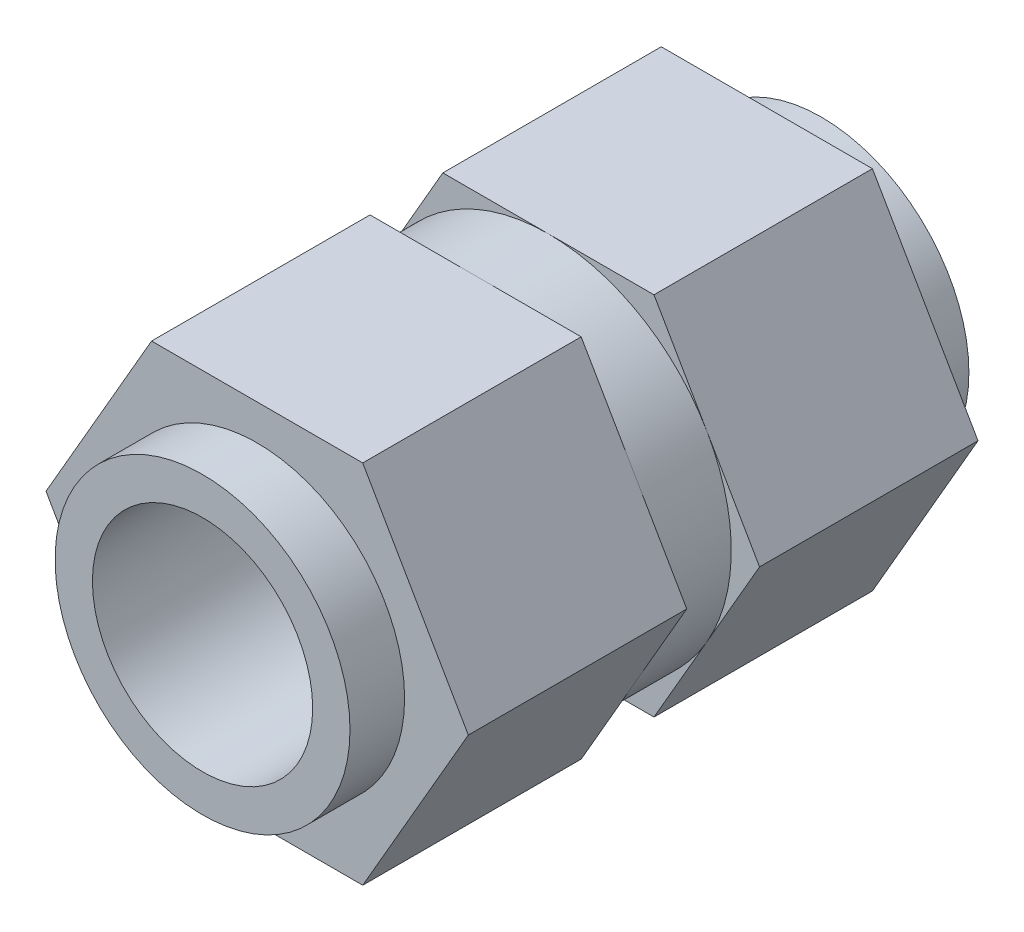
ISO-10303-21;
HEADER;
FILE_DESCRIPTION(('STEP AP214'),'2;1');
FILE_NAME('part.step','',(''),(''),'','','');
FILE_SCHEMA(('AUTOMOTIVE_DESIGN { 1 0 10303 214 1 1 1 1 }'));
ENDSEC;
DATA;
#1=APPLICATION_CONTEXT('core data for automotive mechanical design processes');
#2=APPLICATION_PROTOCOL_DEFINITION('international standard','automotive_design',2000,#1);
#3=PRODUCT_CONTEXT('',#1,'mechanical');
#4=PRODUCT('Part','Part','',(#3));
#5=PRODUCT_RELATED_PRODUCT_CATEGORY('part','',(#4));
#6=PRODUCT_DEFINITION_FORMATION('','',#4);
#7=PRODUCT_DEFINITION_CONTEXT('part definition',#1,'design');
#8=PRODUCT_DEFINITION('design','',#6,#7);
#9=PRODUCT_DEFINITION_SHAPE('','',#8);
#10=(LENGTH_UNIT() NAMED_UNIT(*) SI_UNIT(.MILLI.,.METRE.));
#11=(NAMED_UNIT(*) PLANE_ANGLE_UNIT() SI_UNIT($,.RADIAN.));
#12=(NAMED_UNIT(*) SI_UNIT($,.STERADIAN.) SOLID_ANGLE_UNIT());
#13=UNCERTAINTY_MEASURE_WITH_UNIT(LENGTH_MEASURE(1.E-05),#10,'distance_accuracy_value','');
#14=(GEOMETRIC_REPRESENTATION_CONTEXT(3) GLOBAL_UNCERTAINTY_ASSIGNED_CONTEXT((#13)) GLOBAL_UNIT_ASSIGNED_CONTEXT((#10,
#11,#12)) REPRESENTATION_CONTEXT('',''));
#15=CARTESIAN_POINT('',(0.,0.,0.));
#16=DIRECTION('',(0.,0.,1.));
#17=DIRECTION('',(1.,0.,0.));
#18=AXIS2_PLACEMENT_3D('',#15,#16,#17);
#19=CARTESIAN_POINT('',(0.,0.,14.));
#20=DIRECTION('',(0.,0.,1.));
#21=DIRECTION('',(1.,0.,0.));
#22=AXIS2_PLACEMENT_3D('',#19,#20,#21);
#23=PLANE('',#22);
#24=DIRECTION('',(-0.499999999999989,-0.866025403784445,0.));
#25=VECTOR('',#24,1.);
#26=CARTESIAN_POINT('',(-2.90000000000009,5.02294734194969,14.));
#27=LINE('',#26,#25);
#28=CARTESIAN_POINT('',(-2.90000000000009,5.02294734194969,14.));
#29=VERTEX_POINT('',#28);
#30=CARTESIAN_POINT('',(-5.8,0.,14.));
#31=VERTEX_POINT('',#30);
#32=EDGE_CURVE('E166',#29,#31,#27,.T.);
#33=ORIENTED_EDGE('',*,*,#32,.T.);
#34=DIRECTION('',(0.500000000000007,-0.866025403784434,0.));
#35=VECTOR('',#34,1.);
#36=CARTESIAN_POINT('',(-5.8,0.,14.));
#37=LINE('',#36,#35);
#38=CARTESIAN_POINT('',(-2.89999999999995,-5.02294734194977,14.));
#39=VERTEX_POINT('',#38);
#40=EDGE_CURVE('E155',#31,#39,#37,.T.);
#41=ORIENTED_EDGE('',*,*,#40,.T.);
#42=DIRECTION('',(1.,0.,0.));
#43=VECTOR('',#42,1.);
#44=CARTESIAN_POINT('',(-2.89999999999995,-5.02294734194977,14.));
#45=LINE('',#44,#43);
#46=CARTESIAN_POINT('',(2.90000000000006,-5.02294734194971,14.));
#47=VERTEX_POINT('',#46);
#48=EDGE_CURVE('E165',#39,#47,#45,.T.);
#49=ORIENTED_EDGE('',*,*,#48,.T.);
#50=DIRECTION('',(0.499999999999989,0.866025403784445,0.));
#51=VECTOR('',#50,1.);
#52=CARTESIAN_POINT('',(2.90000000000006,-5.02294734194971,14.));
#53=LINE('',#52,#51);
#54=CARTESIAN_POINT('',(5.8,0.,14.));
#55=VERTEX_POINT('',#54);
#56=EDGE_CURVE('E379',#47,#55,#53,.T.);
#57=ORIENTED_EDGE('',*,*,#56,.T.);
#58=DIRECTION('',(-0.500000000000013,0.866025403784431,0.));
#59=VECTOR('',#58,1.);
#60=CARTESIAN_POINT('',(5.8,0.,14.));
#61=LINE('',#60,#59);
#62=CARTESIAN_POINT('',(2.89999999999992,5.02294734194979,14.));
#63=VERTEX_POINT('',#62);
#64=EDGE_CURVE('E394',#55,#63,#61,.T.);
#65=ORIENTED_EDGE('',*,*,#64,.T.);
#66=DIRECTION('',(-1.,0.,0.));
#67=VECTOR('',#66,1.);
#68=CARTESIAN_POINT('',(2.89999999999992,5.02294734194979,14.));
#69=LINE('',#68,#67);
#70=EDGE_CURVE('E171',#63,#29,#69,.T.);
#71=ORIENTED_EDGE('',*,*,#70,.T.);
#72=EDGE_LOOP('',(#33,#41,#49,#57,#65,#71));
#73=FACE_BOUND('',#72,.T.);
#74=CARTESIAN_POINT('',(0.,0.,14.));
#75=DIRECTION('',(0.,0.,1.));
#76=DIRECTION('',(1.,0.,0.));
#77=AXIS2_PLACEMENT_3D('',#74,#75,#76);
#78=CIRCLE('',#77,4.05);
#79=CARTESIAN_POINT('',(4.05,0.,14.));
#80=VERTEX_POINT('',#79);
#81=EDGE_CURVE('E417',#80,#80,#78,.T.);
#82=ORIENTED_EDGE('',*,*,#81,.F.);
#83=EDGE_LOOP('',(#82));
#84=FACE_BOUND('',#83,.T.);
#85=ADVANCED_FACE('F32',(#73,#84),#23,.T.);
#86=CARTESIAN_POINT('',(0.,0.,0.));
#87=DIRECTION('',(0.,0.,1.));
#88=DIRECTION('',(1.,0.,0.));
#89=AXIS2_PLACEMENT_3D('',#86,#87,#88);
#90=PLANE('',#89);
#91=DIRECTION('',(0.499999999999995,0.866025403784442,0.));
#92=VECTOR('',#91,1.);
#93=CARTESIAN_POINT('',(2.90000000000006,-5.02294734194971,0.));
#94=LINE('',#93,#92);
#95=CARTESIAN_POINT('',(2.90000000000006,-5.02294734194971,0.));
#96=VERTEX_POINT('',#95);
#97=CARTESIAN_POINT('',(5.8,0.,0.));
#98=VERTEX_POINT('',#97);
#99=EDGE_CURVE('E193',#96,#98,#94,.T.);
#100=ORIENTED_EDGE('',*,*,#99,.F.);
#101=DIRECTION('',(1.,0.,0.));
#102=VECTOR('',#101,1.);
#103=CARTESIAN_POINT('',(-2.89999999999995,-5.02294734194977,0.));
#104=LINE('',#103,#102);
#105=CARTESIAN_POINT('',(-2.89999999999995,-5.02294734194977,0.));
#106=VERTEX_POINT('',#105);
#107=EDGE_CURVE('E230',#106,#96,#104,.T.);
#108=ORIENTED_EDGE('',*,*,#107,.F.);
#109=DIRECTION('',(0.500000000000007,-0.866025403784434,0.));
#110=VECTOR('',#109,1.);
#111=CARTESIAN_POINT('',(-5.8,0.,0.));
#112=LINE('',#111,#110);
#113=CARTESIAN_POINT('',(-5.8,0.,0.));
#114=VERTEX_POINT('',#113);
#115=EDGE_CURVE('E228',#114,#106,#112,.T.);
#116=ORIENTED_EDGE('',*,*,#115,.F.);
#117=DIRECTION('',(-0.499999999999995,-0.866025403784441,0.));
#118=VECTOR('',#117,1.);
#119=CARTESIAN_POINT('',(-2.90000000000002,5.02294734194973,0.));
#120=LINE('',#119,#118);
#121=CARTESIAN_POINT('',(-2.90000000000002,5.02294734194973,0.));
#122=VERTEX_POINT('',#121);
#123=EDGE_CURVE('E226',#122,#114,#120,.T.);
#124=ORIENTED_EDGE('',*,*,#123,.F.);
#125=DIRECTION('',(-1.,0.,0.));
#126=VECTOR('',#125,1.);
#127=CARTESIAN_POINT('',(2.89999999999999,5.02294734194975,0.));
#128=LINE('',#127,#126);
#129=CARTESIAN_POINT('',(2.89999999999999,5.02294734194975,0.));
#130=VERTEX_POINT('',#129);
#131=EDGE_CURVE('E224',#130,#122,#128,.T.);
#132=ORIENTED_EDGE('',*,*,#131,.F.);
#133=DIRECTION('',(-0.500000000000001,0.866025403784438,0.));
#134=VECTOR('',#133,1.);
#135=CARTESIAN_POINT('',(5.8,0.,0.));
#136=LINE('',#135,#134);
#137=EDGE_CURVE('E222',#98,#130,#136,.T.);
#138=ORIENTED_EDGE('',*,*,#137,.F.);
#139=EDGE_LOOP('',(#100,#108,#116,#124,#132,#138));
#140=FACE_BOUND('',#139,.T.);
#141=CARTESIAN_POINT('',(0.,0.,0.));
#142=DIRECTION('',(0.,0.,1.));
#143=DIRECTION('',(1.,0.,0.));
#144=AXIS2_PLACEMENT_3D('',#141,#142,#143);
#145=CIRCLE('',#144,4.05);
#146=CARTESIAN_POINT('',(4.05,0.,0.));
#147=VERTEX_POINT('',#146);
#148=EDGE_CURVE('E11',#147,#147,#145,.F.);
#149=ORIENTED_EDGE('',*,*,#148,.F.);
#150=EDGE_LOOP('',(#149));
#151=FACE_BOUND('',#150,.T.);
#152=ADVANCED_FACE('F278',(#140,#151),#90,.F.);
#153=CARTESIAN_POINT('',(0.,0.,6.));
#154=DIRECTION('',(0.,0.,1.));
#155=DIRECTION('',(1.,0.,0.));
#156=AXIS2_PLACEMENT_3D('',#153,#154,#155);
#157=PLANE('',#156);
#158=CARTESIAN_POINT('',(0.,0.,6.));
#159=DIRECTION('',(0.,0.,1.));
#160=DIRECTION('',(1.,0.,0.));
#161=AXIS2_PLACEMENT_3D('',#158,#159,#160);
#162=CIRCLE('',#161,5.02294734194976);
#163=CARTESIAN_POINT('',(4.35000000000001,2.51147367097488,6.));
#164=VERTEX_POINT('',#163);
#165=CARTESIAN_POINT('',(0.,5.02294734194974,6.));
#166=VERTEX_POINT('',#165);
#167=EDGE_CURVE('E182',#164,#166,#162,.T.);
#168=ORIENTED_EDGE('',*,*,#167,.F.);
#169=DIRECTION('',(-0.500000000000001,0.866025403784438,0.));
#170=VECTOR('',#169,1.);
#171=CARTESIAN_POINT('',(5.8,0.,6.));
#172=LINE('',#171,#170);
#173=CARTESIAN_POINT('',(2.89999999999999,5.02294734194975,6.));
#174=VERTEX_POINT('',#173);
#175=EDGE_CURVE('E199',#164,#174,#172,.T.);
#176=ORIENTED_EDGE('',*,*,#175,.T.);
#177=DIRECTION('',(-1.,0.,0.));
#178=VECTOR('',#177,1.);
#179=CARTESIAN_POINT('',(2.89999999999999,5.02294734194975,6.));
#180=LINE('',#179,#178);
#181=EDGE_CURVE('E204',#174,#166,#180,.T.);
#182=ORIENTED_EDGE('',*,*,#181,.T.);
#183=EDGE_LOOP('',(#168,#176,#182));
#184=FACE_BOUND('',#183,.T.);
#185=ADVANCED_FACE('F270',(#184),#157,.T.);
#186=CARTESIAN_POINT('',(-4.35000000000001,2.51147367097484,6.));
#187=VERTEX_POINT('',#186);
#188=EDGE_CURVE('E40',#166,#187,#162,.T.);
#189=ORIENTED_EDGE('',*,*,#188,.F.);
#190=CARTESIAN_POINT('',(-2.90000000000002,5.02294734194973,6.));
#191=VERTEX_POINT('',#190);
#192=EDGE_CURVE('E203',#166,#191,#180,.T.);
#193=ORIENTED_EDGE('',*,*,#192,.T.);
#194=DIRECTION('',(-0.499999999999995,-0.866025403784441,0.));
#195=VECTOR('',#194,1.);
#196=CARTESIAN_POINT('',(-2.90000000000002,5.02294734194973,6.));
#197=LINE('',#196,#195);
#198=EDGE_CURVE('E208',#191,#187,#197,.T.);
#199=ORIENTED_EDGE('',*,*,#198,.T.);
#200=EDGE_LOOP('',(#189,#193,#199));
#201=FACE_BOUND('',#200,.T.);
#202=ADVANCED_FACE('F263',(#201),#157,.T.);
#203=CARTESIAN_POINT('',(-4.34999999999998,-2.51147367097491,6.));
#204=VERTEX_POINT('',#203);
#205=EDGE_CURVE('E256',#187,#204,#162,.T.);
#206=ORIENTED_EDGE('',*,*,#205,.F.);
#207=CARTESIAN_POINT('',(-5.8,0.,6.));
#208=VERTEX_POINT('',#207);
#209=EDGE_CURVE('E207',#187,#208,#197,.T.);
#210=ORIENTED_EDGE('',*,*,#209,.T.);
#211=DIRECTION('',(0.500000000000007,-0.866025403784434,0.));
#212=VECTOR('',#211,1.);
#213=CARTESIAN_POINT('',(-5.8,0.,6.));
#214=LINE('',#213,#212);
#215=EDGE_CURVE('E212',#208,#204,#214,.T.);
#216=ORIENTED_EDGE('',*,*,#215,.T.);
#217=EDGE_LOOP('',(#206,#210,#216));
#218=FACE_BOUND('',#217,.T.);
#219=ADVANCED_FACE('F292',(#218),#157,.T.);
#220=CARTESIAN_POINT('',(0.,-5.02294734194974,6.));
#221=VERTEX_POINT('',#220);
#222=EDGE_CURVE('E254',#204,#221,#162,.T.);
#223=ORIENTED_EDGE('',*,*,#222,.F.);
#224=CARTESIAN_POINT('',(-2.89999999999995,-5.02294734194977,6.));
#225=VERTEX_POINT('',#224);
#226=EDGE_CURVE('E211',#204,#225,#214,.T.);
#227=ORIENTED_EDGE('',*,*,#226,.T.);
#228=DIRECTION('',(1.,0.,0.));
#229=VECTOR('',#228,1.);
#230=CARTESIAN_POINT('',(-2.89999999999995,-5.02294734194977,6.));
#231=LINE('',#230,#229);
#232=EDGE_CURVE('E216',#225,#221,#231,.T.);
#233=ORIENTED_EDGE('',*,*,#232,.T.);
#234=EDGE_LOOP('',(#223,#227,#233));
#235=FACE_BOUND('',#234,.T.);
#236=ADVANCED_FACE('F294',(#235),#157,.T.);
#237=CARTESIAN_POINT('',(4.35000000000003,-2.51147367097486,6.));
#238=VERTEX_POINT('',#237);
#239=EDGE_CURVE('E251',#221,#238,#162,.T.);
#240=ORIENTED_EDGE('',*,*,#239,.F.);
#241=CARTESIAN_POINT('',(2.90000000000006,-5.02294734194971,6.));
#242=VERTEX_POINT('',#241);
#243=EDGE_CURVE('E215',#221,#242,#231,.T.);
#244=ORIENTED_EDGE('',*,*,#243,.T.);
#245=DIRECTION('',(0.499999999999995,0.866025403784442,0.));
#246=VECTOR('',#245,1.);
#247=CARTESIAN_POINT('',(2.90000000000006,-5.02294734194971,6.));
#248=LINE('',#247,#246);
#249=EDGE_CURVE('E196',#242,#238,#248,.T.);
#250=ORIENTED_EDGE('',*,*,#249,.T.);
#251=EDGE_LOOP('',(#240,#244,#250));
#252=FACE_BOUND('',#251,.T.);
#253=ADVANCED_FACE('F300',(#252),#157,.T.);
#254=CARTESIAN_POINT('',(2.90000000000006,-5.02294734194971,6.));
#255=DIRECTION('',(-0.866025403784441,0.499999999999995,0.));
#256=DIRECTION('',(-0.499999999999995,-0.866025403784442,0.));
#257=AXIS2_PLACEMENT_3D('',#254,#255,#256);
#258=PLANE('',#257);
#259=ORIENTED_EDGE('',*,*,#99,.T.);
#260=DIRECTION('',(0.,0.,-1.));
#261=VECTOR('',#260,1.);
#262=CARTESIAN_POINT('',(5.8,0.,6.));
#263=LINE('',#262,#261);
#264=CARTESIAN_POINT('',(5.8,0.,6.));
#265=VERTEX_POINT('',#264);
#266=EDGE_CURVE('E245',#265,#98,#263,.T.);
#267=ORIENTED_EDGE('',*,*,#266,.F.);
#268=EDGE_CURVE('E200',#238,#265,#248,.T.);
#269=ORIENTED_EDGE('',*,*,#268,.F.);
#270=ORIENTED_EDGE('',*,*,#249,.F.);
#271=DIRECTION('',(0.,0.,-1.));
#272=VECTOR('',#271,1.);
#273=CARTESIAN_POINT('',(2.90000000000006,-5.02294734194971,6.));
#274=LINE('',#273,#272);
#275=EDGE_CURVE('E219',#242,#96,#274,.T.);
#276=ORIENTED_EDGE('',*,*,#275,.T.);
#277=EDGE_LOOP('',(#259,#267,#269,#270,#276));
#278=FACE_BOUND('',#277,.T.);
#279=ADVANCED_FACE('F34',(#278),#258,.F.);
#280=CARTESIAN_POINT('',(5.8,0.,6.));
#281=DIRECTION('',(-0.866025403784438,-0.500000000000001,0.));
#282=DIRECTION('',(0.500000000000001,-0.866025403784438,0.));
#283=AXIS2_PLACEMENT_3D('',#280,#281,#282);
#284=PLANE('',#283);
#285=ORIENTED_EDGE('',*,*,#137,.T.);
#286=DIRECTION('',(0.,0.,-1.));
#287=VECTOR('',#286,1.);
#288=CARTESIAN_POINT('',(2.89999999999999,5.02294734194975,6.));
#289=LINE('',#288,#287);
#290=EDGE_CURVE('E243',#174,#130,#289,.T.);
#291=ORIENTED_EDGE('',*,*,#290,.F.);
#292=ORIENTED_EDGE('',*,*,#175,.F.);
#293=EDGE_CURVE('E201',#265,#164,#172,.T.);
#294=ORIENTED_EDGE('',*,*,#293,.F.);
#295=ORIENTED_EDGE('',*,*,#266,.T.);
#296=EDGE_LOOP('',(#285,#291,#292,#294,#295));
#297=FACE_BOUND('',#296,.T.);
#298=ADVANCED_FACE('F273',(#297),#284,.F.);
#299=CARTESIAN_POINT('',(2.89999999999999,5.02294734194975,6.));
#300=DIRECTION('',(0.,-1.,0.));
#301=DIRECTION('',(1.,0.,0.));
#302=AXIS2_PLACEMENT_3D('',#299,#300,#301);
#303=PLANE('',#302);
#304=ORIENTED_EDGE('',*,*,#131,.T.);
#305=DIRECTION('',(0.,0.,-1.));
#306=VECTOR('',#305,1.);
#307=CARTESIAN_POINT('',(-2.90000000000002,5.02294734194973,6.));
#308=LINE('',#307,#306);
#309=EDGE_CURVE('E240',#191,#122,#308,.T.);
#310=ORIENTED_EDGE('',*,*,#309,.F.);
#311=ORIENTED_EDGE('',*,*,#192,.F.);
#312=ORIENTED_EDGE('',*,*,#181,.F.);
#313=ORIENTED_EDGE('',*,*,#290,.T.);
#314=EDGE_LOOP('',(#304,#310,#311,#312,#313));
#315=FACE_BOUND('',#314,.T.);
#316=ADVANCED_FACE('F268',(#315),#303,.F.);
#317=CARTESIAN_POINT('',(-2.90000000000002,5.02294734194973,6.));
#318=DIRECTION('',(0.866025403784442,-0.499999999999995,0.));
#319=DIRECTION('',(0.499999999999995,0.866025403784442,0.));
#320=AXIS2_PLACEMENT_3D('',#317,#318,#319);
#321=PLANE('',#320);
#322=ORIENTED_EDGE('',*,*,#123,.T.);
#323=DIRECTION('',(0.,0.,-1.));
#324=VECTOR('',#323,1.);
#325=CARTESIAN_POINT('',(-5.8,0.,6.));
#326=LINE('',#325,#324);
#327=EDGE_CURVE('E237',#208,#114,#326,.T.);
#328=ORIENTED_EDGE('',*,*,#327,.F.);
#329=ORIENTED_EDGE('',*,*,#209,.F.);
#330=ORIENTED_EDGE('',*,*,#198,.F.);
#331=ORIENTED_EDGE('',*,*,#309,.T.);
#332=EDGE_LOOP('',(#322,#328,#329,#330,#331));
#333=FACE_BOUND('',#332,.T.);
#334=ADVANCED_FACE('F284',(#333),#321,.F.);
#335=CARTESIAN_POINT('',(-5.8,0.,6.));
#336=DIRECTION('',(0.866025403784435,0.500000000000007,0.));
#337=DIRECTION('',(-0.500000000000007,0.866025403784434,0.));
#338=AXIS2_PLACEMENT_3D('',#335,#336,#337);
#339=PLANE('',#338);
#340=ORIENTED_EDGE('',*,*,#115,.T.);
#341=DIRECTION('',(0.,0.,-1.));
#342=VECTOR('',#341,1.);
#343=CARTESIAN_POINT('',(-2.89999999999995,-5.02294734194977,6.));
#344=LINE('',#343,#342);
#345=EDGE_CURVE('E234',#225,#106,#344,.T.);
#346=ORIENTED_EDGE('',*,*,#345,.F.);
#347=ORIENTED_EDGE('',*,*,#226,.F.);
#348=ORIENTED_EDGE('',*,*,#215,.F.);
#349=ORIENTED_EDGE('',*,*,#327,.T.);
#350=EDGE_LOOP('',(#340,#346,#347,#348,#349));
#351=FACE_BOUND('',#350,.T.);
#352=ADVANCED_FACE('F288',(#351),#339,.F.);
#353=CARTESIAN_POINT('',(-2.89999999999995,-5.02294734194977,6.));
#354=DIRECTION('',(0.,1.,0.));
#355=DIRECTION('',(-1.,0.,0.));
#356=AXIS2_PLACEMENT_3D('',#353,#354,#355);
#357=PLANE('',#356);
#358=ORIENTED_EDGE('',*,*,#107,.T.);
#359=ORIENTED_EDGE('',*,*,#275,.F.);
#360=ORIENTED_EDGE('',*,*,#243,.F.);
#361=ORIENTED_EDGE('',*,*,#232,.F.);
#362=ORIENTED_EDGE('',*,*,#345,.T.);
#363=EDGE_LOOP('',(#358,#359,#360,#361,#362));
#364=FACE_BOUND('',#363,.T.);
#365=ADVANCED_FACE('F343',(#364),#357,.F.);
#366=EDGE_CURVE('E186',#238,#164,#162,.T.);
#367=ORIENTED_EDGE('',*,*,#366,.F.);
#368=ORIENTED_EDGE('',*,*,#268,.T.);
#369=ORIENTED_EDGE('',*,*,#293,.T.);
#370=EDGE_LOOP('',(#367,#368,#369));
#371=FACE_BOUND('',#370,.T.);
#372=ADVANCED_FACE('F302',(#371),#157,.T.);
#373=CARTESIAN_POINT('',(0.,0.,8.));
#374=DIRECTION('',(0.,0.,-1.));
#375=DIRECTION('',(-1.,0.,0.));
#376=AXIS2_PLACEMENT_3D('',#373,#374,#375);
#377=CYLINDRICAL_SURFACE('',#376,5.02294734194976);
#378=CARTESIAN_POINT('',(0.,0.,8.));
#379=DIRECTION('',(0.,0.,1.));
#380=DIRECTION('',(1.,0.,0.));
#381=AXIS2_PLACEMENT_3D('',#378,#379,#380);
#382=CIRCLE('',#381,5.02294734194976);
#383=CARTESIAN_POINT('',(4.34999999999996,2.51147367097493,8.));
#384=VERTEX_POINT('',#383);
#385=CARTESIAN_POINT('',(0.,5.02294734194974,8.));
#386=VERTEX_POINT('',#385);
#387=EDGE_CURVE('E191',#384,#386,#382,.T.);
#388=ORIENTED_EDGE('',*,*,#387,.F.);
#389=CARTESIAN_POINT('',(4.35000000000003,-2.51147367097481,8.));
#390=VERTEX_POINT('',#389);
#391=EDGE_CURVE('E47',#390,#384,#382,.T.);
#392=ORIENTED_EDGE('',*,*,#391,.F.);
#393=CARTESIAN_POINT('',(0.,-5.02294734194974,8.));
#394=VERTEX_POINT('',#393);
#395=EDGE_CURVE('E51',#394,#390,#382,.T.);
#396=ORIENTED_EDGE('',*,*,#395,.F.);
#397=CARTESIAN_POINT('',(-4.34999999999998,-2.51147367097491,8.));
#398=VERTEX_POINT('',#397);
#399=EDGE_CURVE('E711',#398,#394,#382,.T.);
#400=ORIENTED_EDGE('',*,*,#399,.F.);
#401=CARTESIAN_POINT('',(-4.35000000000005,2.51147367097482,8.));
#402=VERTEX_POINT('',#401);
#403=EDGE_CURVE('E713',#402,#398,#382,.T.);
#404=ORIENTED_EDGE('',*,*,#403,.F.);
#405=EDGE_CURVE('E194',#386,#402,#382,.T.);
#406=ORIENTED_EDGE('',*,*,#405,.F.);
#407=EDGE_LOOP('',(#388,#392,#396,#400,#404,#406));
#408=FACE_BOUND('',#407,.T.);
#409=ORIENTED_EDGE('',*,*,#167,.T.);
#410=ORIENTED_EDGE('',*,*,#188,.T.);
#411=ORIENTED_EDGE('',*,*,#205,.T.);
#412=ORIENTED_EDGE('',*,*,#222,.T.);
#413=ORIENTED_EDGE('',*,*,#239,.T.);
#414=ORIENTED_EDGE('',*,*,#366,.T.);
#415=EDGE_LOOP('',(#409,#410,#411,#412,#413,#414));
#416=FACE_BOUND('',#415,.T.);
#417=ADVANCED_FACE('F259',(#408,#416),#377,.T.);
#418=CARTESIAN_POINT('',(0.,0.,8.));
#419=DIRECTION('',(0.,0.,1.));
#420=DIRECTION('',(1.,0.,0.));
#421=AXIS2_PLACEMENT_3D('',#418,#419,#420);
#422=PLANE('',#421);
#423=DIRECTION('',(-0.500000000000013,0.866025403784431,0.));
#424=VECTOR('',#423,1.);
#425=CARTESIAN_POINT('',(5.8,0.,8.));
#426=LINE('',#425,#424);
#427=CARTESIAN_POINT('',(2.89999999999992,5.02294734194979,8.));
#428=VERTEX_POINT('',#427);
#429=EDGE_CURVE('E356',#384,#428,#426,.T.);
#430=ORIENTED_EDGE('',*,*,#429,.F.);
#431=ORIENTED_EDGE('',*,*,#387,.T.);
#432=DIRECTION('',(-1.,0.,0.));
#433=VECTOR('',#432,1.);
#434=CARTESIAN_POINT('',(2.89999999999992,5.02294734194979,8.));
#435=LINE('',#434,#433);
#436=EDGE_CURVE('E175',#428,#386,#435,.T.);
#437=ORIENTED_EDGE('',*,*,#436,.F.);
#438=EDGE_LOOP('',(#430,#431,#437));
#439=FACE_BOUND('',#438,.T.);
#440=ADVANCED_FACE('F314',(#439),#422,.F.);
#441=CARTESIAN_POINT('',(-2.90000000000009,5.02294734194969,8.));
#442=VERTEX_POINT('',#441);
#443=EDGE_CURVE('E366',#386,#442,#435,.T.);
#444=ORIENTED_EDGE('',*,*,#443,.F.);
#445=ORIENTED_EDGE('',*,*,#405,.T.);
#446=DIRECTION('',(-0.499999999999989,-0.866025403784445,0.));
#447=VECTOR('',#446,1.);
#448=CARTESIAN_POINT('',(-2.90000000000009,5.02294734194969,8.));
#449=LINE('',#448,#447);
#450=EDGE_CURVE('E391',#442,#402,#449,.T.);
#451=ORIENTED_EDGE('',*,*,#450,.F.);
#452=EDGE_LOOP('',(#444,#445,#451));
#453=FACE_BOUND('',#452,.T.);
#454=ADVANCED_FACE('F317',(#453),#422,.F.);
#455=CARTESIAN_POINT('',(-5.8,0.,8.));
#456=VERTEX_POINT('',#455);
#457=EDGE_CURVE('E180',#402,#456,#449,.T.);
#458=ORIENTED_EDGE('',*,*,#457,.F.);
#459=ORIENTED_EDGE('',*,*,#403,.T.);
#460=DIRECTION('',(0.500000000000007,-0.866025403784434,0.));
#461=VECTOR('',#460,1.);
#462=CARTESIAN_POINT('',(-5.8,0.,8.));
#463=LINE('',#462,#461);
#464=EDGE_CURVE('E387',#456,#398,#463,.T.);
#465=ORIENTED_EDGE('',*,*,#464,.F.);
#466=EDGE_LOOP('',(#458,#459,#465));
#467=FACE_BOUND('',#466,.T.);
#468=ADVANCED_FACE('F514',(#467),#422,.F.);
#469=CARTESIAN_POINT('',(-2.89999999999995,-5.02294734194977,8.));
#470=VERTEX_POINT('',#469);
#471=EDGE_CURVE('E390',#398,#470,#463,.T.);
#472=ORIENTED_EDGE('',*,*,#471,.F.);
#473=ORIENTED_EDGE('',*,*,#399,.T.);
#474=DIRECTION('',(1.,0.,0.));
#475=VECTOR('',#474,1.);
#476=CARTESIAN_POINT('',(-2.89999999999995,-5.02294734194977,8.));
#477=LINE('',#476,#475);
#478=EDGE_CURVE('E385',#470,#394,#477,.T.);
#479=ORIENTED_EDGE('',*,*,#478,.F.);
#480=EDGE_LOOP('',(#472,#473,#479));
#481=FACE_BOUND('',#480,.T.);
#482=ADVANCED_FACE('F508',(#481),#422,.F.);
#483=CARTESIAN_POINT('',(2.90000000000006,-5.02294734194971,8.));
#484=VERTEX_POINT('',#483);
#485=EDGE_CURVE('E383',#394,#484,#477,.T.);
#486=ORIENTED_EDGE('',*,*,#485,.F.);
#487=ORIENTED_EDGE('',*,*,#395,.T.);
#488=DIRECTION('',(0.499999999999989,0.866025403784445,0.));
#489=VECTOR('',#488,1.);
#490=CARTESIAN_POINT('',(2.90000000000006,-5.02294734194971,8.));
#491=LINE('',#490,#489);
#492=EDGE_CURVE('E360',#484,#390,#491,.T.);
#493=ORIENTED_EDGE('',*,*,#492,.F.);
#494=EDGE_LOOP('',(#486,#487,#493));
#495=FACE_BOUND('',#494,.T.);
#496=ADVANCED_FACE('F382',(#495),#422,.F.);
#497=CARTESIAN_POINT('',(5.8,0.,8.));
#498=VERTEX_POINT('',#497);
#499=EDGE_CURVE('E354',#390,#498,#491,.T.);
#500=ORIENTED_EDGE('',*,*,#499,.F.);
#501=ORIENTED_EDGE('',*,*,#391,.T.);
#502=EDGE_CURVE('E353',#498,#384,#426,.T.);
#503=ORIENTED_EDGE('',*,*,#502,.F.);
#504=EDGE_LOOP('',(#500,#501,#503));
#505=FACE_BOUND('',#504,.T.);
#506=ADVANCED_FACE('F319',(#505),#422,.F.);
#507=CARTESIAN_POINT('',(-2.90000000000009,5.02294734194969,14.));
#508=DIRECTION('',(0.866025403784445,-0.499999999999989,0.));
#509=DIRECTION('',(0.499999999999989,0.866025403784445,0.));
#510=AXIS2_PLACEMENT_3D('',#507,#508,#509);
#511=PLANE('',#510);
#512=ORIENTED_EDGE('',*,*,#450,.T.);
#513=ORIENTED_EDGE('',*,*,#457,.T.);
#514=DIRECTION('',(0.,0.,-1.));
#515=VECTOR('',#514,1.);
#516=CARTESIAN_POINT('',(-5.8,0.,14.));
#517=LINE('',#516,#515);
#518=EDGE_CURVE('E160',#31,#456,#517,.T.);
#519=ORIENTED_EDGE('',*,*,#518,.F.);
#520=ORIENTED_EDGE('',*,*,#32,.F.);
#521=DIRECTION('',(0.,0.,-1.));
#522=VECTOR('',#521,1.);
#523=CARTESIAN_POINT('',(-2.90000000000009,5.02294734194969,14.));
#524=LINE('',#523,#522);
#525=EDGE_CURVE('E371',#29,#442,#524,.T.);
#526=ORIENTED_EDGE('',*,*,#525,.T.);
#527=EDGE_LOOP('',(#512,#513,#519,#520,#526));
#528=FACE_BOUND('',#527,.T.);
#529=ADVANCED_FACE('F178',(#528),#511,.F.);
#530=CARTESIAN_POINT('',(-5.8,0.,14.));
#531=DIRECTION('',(0.866025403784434,0.500000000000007,0.));
#532=DIRECTION('',(-0.500000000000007,0.866025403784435,0.));
#533=AXIS2_PLACEMENT_3D('',#530,#531,#532);
#534=PLANE('',#533);
#535=ORIENTED_EDGE('',*,*,#464,.T.);
#536=ORIENTED_EDGE('',*,*,#471,.T.);
#537=DIRECTION('',(0.,0.,-1.));
#538=VECTOR('',#537,1.);
#539=CARTESIAN_POINT('',(-2.89999999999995,-5.02294734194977,14.));
#540=LINE('',#539,#538);
#541=EDGE_CURVE('E162',#39,#470,#540,.T.);
#542=ORIENTED_EDGE('',*,*,#541,.F.);
#543=ORIENTED_EDGE('',*,*,#40,.F.);
#544=ORIENTED_EDGE('',*,*,#518,.T.);
#545=EDGE_LOOP('',(#535,#536,#542,#543,#544));
#546=FACE_BOUND('',#545,.T.);
#547=ADVANCED_FACE('F158',(#546),#534,.F.);
#548=CARTESIAN_POINT('',(-2.89999999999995,-5.02294734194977,14.));
#549=DIRECTION('',(0.,1.,0.));
#550=DIRECTION('',(-1.,0.,0.));
#551=AXIS2_PLACEMENT_3D('',#548,#549,#550);
#552=PLANE('',#551);
#553=ORIENTED_EDGE('',*,*,#478,.T.);
#554=ORIENTED_EDGE('',*,*,#485,.T.);
#555=DIRECTION('',(0.,0.,-1.));
#556=VECTOR('',#555,1.);
#557=CARTESIAN_POINT('',(2.90000000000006,-5.02294734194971,14.));
#558=LINE('',#557,#556);
#559=EDGE_CURVE('E187',#47,#484,#558,.T.);
#560=ORIENTED_EDGE('',*,*,#559,.F.);
#561=ORIENTED_EDGE('',*,*,#48,.F.);
#562=ORIENTED_EDGE('',*,*,#541,.T.);
#563=EDGE_LOOP('',(#553,#554,#560,#561,#562));
#564=FACE_BOUND('',#563,.T.);
#565=ADVANCED_FACE('F331',(#564),#552,.F.);
#566=CARTESIAN_POINT('',(2.90000000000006,-5.02294734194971,14.));
#567=DIRECTION('',(-0.866025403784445,0.499999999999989,0.));
#568=DIRECTION('',(-0.499999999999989,-0.866025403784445,0.));
#569=AXIS2_PLACEMENT_3D('',#566,#567,#568);
#570=PLANE('',#569);
#571=ORIENTED_EDGE('',*,*,#492,.T.);
#572=ORIENTED_EDGE('',*,*,#499,.T.);
#573=DIRECTION('',(0.,0.,-1.));
#574=VECTOR('',#573,1.);
#575=CARTESIAN_POINT('',(5.8,0.,14.));
#576=LINE('',#575,#574);
#577=EDGE_CURVE('E365',#55,#498,#576,.T.);
#578=ORIENTED_EDGE('',*,*,#577,.F.);
#579=ORIENTED_EDGE('',*,*,#56,.F.);
#580=ORIENTED_EDGE('',*,*,#559,.T.);
#581=EDGE_LOOP('',(#571,#572,#578,#579,#580));
#582=FACE_BOUND('',#581,.T.);
#583=ADVANCED_FACE('F327',(#582),#570,.F.);
#584=CARTESIAN_POINT('',(5.8,0.,14.));
#585=DIRECTION('',(-0.866025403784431,-0.500000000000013,0.));
#586=DIRECTION('',(0.500000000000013,-0.866025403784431,0.));
#587=AXIS2_PLACEMENT_3D('',#584,#585,#586);
#588=PLANE('',#587);
#589=ORIENTED_EDGE('',*,*,#502,.T.);
#590=ORIENTED_EDGE('',*,*,#429,.T.);
#591=DIRECTION('',(0.,0.,-1.));
#592=VECTOR('',#591,1.);
#593=CARTESIAN_POINT('',(2.89999999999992,5.02294734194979,14.));
#594=LINE('',#593,#592);
#595=EDGE_CURVE('E373',#63,#428,#594,.T.);
#596=ORIENTED_EDGE('',*,*,#595,.F.);
#597=ORIENTED_EDGE('',*,*,#64,.F.);
#598=ORIENTED_EDGE('',*,*,#577,.T.);
#599=EDGE_LOOP('',(#589,#590,#596,#597,#598));
#600=FACE_BOUND('',#599,.T.);
#601=ADVANCED_FACE('F323',(#600),#588,.F.);
#602=CARTESIAN_POINT('',(2.89999999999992,5.02294734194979,14.));
#603=DIRECTION('',(0.,-1.,0.));
#604=DIRECTION('',(1.,0.,0.));
#605=AXIS2_PLACEMENT_3D('',#602,#603,#604);
#606=PLANE('',#605);
#607=ORIENTED_EDGE('',*,*,#436,.T.);
#608=ORIENTED_EDGE('',*,*,#443,.T.);
#609=ORIENTED_EDGE('',*,*,#525,.F.);
#610=ORIENTED_EDGE('',*,*,#70,.F.);
#611=ORIENTED_EDGE('',*,*,#595,.T.);
#612=EDGE_LOOP('',(#607,#608,#609,#610,#611));
#613=FACE_BOUND('',#612,.T.);
#614=ADVANCED_FACE('F320',(#613),#606,.F.);
#615=CARTESIAN_POINT('',(0.,0.,-1.5));
#616=DIRECTION('',(0.,0.,1.));
#617=DIRECTION('',(1.,0.,0.));
#618=AXIS2_PLACEMENT_3D('',#615,#616,#617);
#619=CYLINDRICAL_SURFACE('',#618,4.05);
#620=CARTESIAN_POINT('',(0.,0.,-1.5));
#621=DIRECTION('',(0.,0.,-1.));
#622=DIRECTION('',(-1.,0.,0.));
#623=AXIS2_PLACEMENT_3D('',#620,#621,#622);
#624=CIRCLE('',#623,4.05);
#625=CARTESIAN_POINT('',(-4.05,0.,-1.5));
#626=VERTEX_POINT('',#625);
#627=EDGE_CURVE('E398',#626,#626,#624,.T.);
#628=ORIENTED_EDGE('',*,*,#627,.F.);
#629=EDGE_LOOP('',(#628));
#630=FACE_BOUND('',#629,.T.);
#631=ORIENTED_EDGE('',*,*,#148,.T.);
#632=EDGE_LOOP('',(#631));
#633=FACE_BOUND('',#632,.T.);
#634=ADVANCED_FACE('F312',(#630,#633),#619,.T.);
#635=CARTESIAN_POINT('',(0.,0.,-1.5));
#636=DIRECTION('',(0.,0.,-1.));
#637=DIRECTION('',(-1.,0.,0.));
#638=AXIS2_PLACEMENT_3D('',#635,#636,#637);
#639=PLANE('',#638);
#640=CARTESIAN_POINT('',(0.,0.,-1.5));
#641=DIRECTION('',(0.,0.,-1.));
#642=DIRECTION('',(-1.,0.,0.));
#643=AXIS2_PLACEMENT_3D('',#640,#641,#642);
#644=CIRCLE('',#643,2.5);
#645=CARTESIAN_POINT('',(-2.5,0.,-1.5));
#646=VERTEX_POINT('',#645);
#647=EDGE_CURVE('E402',#646,#646,#644,.T.);
#648=ORIENTED_EDGE('',*,*,#647,.F.);
#649=EDGE_LOOP('',(#648));
#650=FACE_BOUND('',#649,.T.);
#651=ORIENTED_EDGE('',*,*,#627,.T.);
#652=EDGE_LOOP('',(#651));
#653=FACE_BOUND('',#652,.T.);
#654=ADVANCED_FACE('F456',(#650,#653),#639,.T.);
#655=CARTESIAN_POINT('',(0.,0.,-0.5));
#656=DIRECTION('',(0.,0.,-1.));
#657=DIRECTION('',(-1.,0.,0.));
#658=AXIS2_PLACEMENT_3D('',#655,#656,#657);
#659=CYLINDRICAL_SURFACE('',#658,2.5);
#660=CARTESIAN_POINT('',(0.,0.,-0.5));
#661=DIRECTION('',(0.,0.,-1.));
#662=DIRECTION('',(-1.,0.,0.));
#663=AXIS2_PLACEMENT_3D('',#660,#661,#662);
#664=CIRCLE('',#663,2.5);
#665=CARTESIAN_POINT('',(-2.5,0.,-0.5));
#666=VERTEX_POINT('',#665);
#667=EDGE_CURVE('E401',#666,#666,#664,.T.);
#668=ORIENTED_EDGE('',*,*,#667,.F.);
#669=EDGE_LOOP('',(#668));
#670=FACE_BOUND('',#669,.T.);
#671=ORIENTED_EDGE('',*,*,#647,.T.);
#672=EDGE_LOOP('',(#671));
#673=FACE_BOUND('',#672,.T.);
#674=ADVANCED_FACE('F453',(#670,#673),#659,.F.);
#675=CARTESIAN_POINT('',(0.,0.,-0.5));
#676=DIRECTION('',(0.,0.,-1.));
#677=DIRECTION('',(-1.,0.,0.));
#678=AXIS2_PLACEMENT_3D('',#675,#676,#677);
#679=PLANE('',#678);
#680=CARTESIAN_POINT('',(0.,0.,-0.5));
#681=DIRECTION('',(0.,0.,-1.));
#682=DIRECTION('',(-1.,0.,0.));
#683=AXIS2_PLACEMENT_3D('',#680,#681,#682);
#684=CIRCLE('',#683,1.5);
#685=CARTESIAN_POINT('',(-1.5,0.,-0.5));
#686=VERTEX_POINT('',#685);
#687=EDGE_CURVE('E405',#686,#686,#684,.T.);
#688=ORIENTED_EDGE('',*,*,#687,.F.);
#689=EDGE_LOOP('',(#688));
#690=FACE_BOUND('',#689,.T.);
#691=ORIENTED_EDGE('',*,*,#667,.T.);
#692=EDGE_LOOP('',(#691));
#693=FACE_BOUND('',#692,.T.);
#694=ADVANCED_FACE('F449',(#690,#693),#679,.T.);
#695=CARTESIAN_POINT('',(0.,0.,1.25));
#696=DIRECTION('',(0.,0.,-1.));
#697=DIRECTION('',(-1.,0.,0.));
#698=AXIS2_PLACEMENT_3D('',#695,#696,#697);
#699=CYLINDRICAL_SURFACE('',#698,1.5);
#700=CARTESIAN_POINT('',(0.,0.,1.25));
#701=DIRECTION('',(0.,0.,-1.));
#702=DIRECTION('',(-1.,0.,0.));
#703=AXIS2_PLACEMENT_3D('',#700,#701,#702);
#704=CIRCLE('',#703,1.5);
#705=CARTESIAN_POINT('',(-1.5,0.,1.25));
#706=VERTEX_POINT('',#705);
#707=EDGE_CURVE('E410',#706,#706,#704,.F.);
#708=ORIENTED_EDGE('',*,*,#707,.T.);
#709=EDGE_LOOP('',(#708));
#710=FACE_BOUND('',#709,.T.);
#711=ORIENTED_EDGE('',*,*,#687,.T.);
#712=EDGE_LOOP('',(#711));
#713=FACE_BOUND('',#712,.T.);
#714=ADVANCED_FACE('F445',(#710,#713),#699,.F.);
#715=CARTESIAN_POINT('',(0.,0.,1.25));
#716=DIRECTION('',(0.,0.,-1.));
#717=DIRECTION('',(-1.,0.,0.));
#718=AXIS2_PLACEMENT_3D('',#715,#716,#717);
#719=PLANE('',#718);
#720=CARTESIAN_POINT('',(0.,0.,1.25));
#721=DIRECTION('',(0.,0.,-1.));
#722=DIRECTION('',(-1.,0.,0.));
#723=AXIS2_PLACEMENT_3D('',#720,#721,#722);
#724=CIRCLE('',#723,3.025);
#725=CARTESIAN_POINT('',(-3.025,0.,1.25));
#726=VERTEX_POINT('',#725);
#727=EDGE_CURVE('E413',#726,#726,#724,.F.);
#728=ORIENTED_EDGE('',*,*,#727,.T.);
#729=EDGE_LOOP('',(#728));
#730=FACE_BOUND('',#729,.T.);
#731=ORIENTED_EDGE('',*,*,#707,.F.);
#732=EDGE_LOOP('',(#731));
#733=FACE_BOUND('',#732,.T.);
#734=ADVANCED_FACE('F439',(#730,#733),#719,.F.);
#735=CARTESIAN_POINT('',(0.,0.,-7.30599205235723));
#736=DIRECTION('',(0.,0.,1.));
#737=DIRECTION('',(1.,0.,0.));
#738=AXIS2_PLACEMENT_3D('',#735,#736,#737);
#739=CYLINDRICAL_SURFACE('',#738,3.025);
#740=ORIENTED_EDGE('',*,*,#727,.F.);
#741=EDGE_LOOP('',(#740));
#742=FACE_BOUND('',#741,.T.);
#743=CARTESIAN_POINT('',(0.,0.,15.5));
#744=DIRECTION('',(0.,0.,1.));
#745=DIRECTION('',(1.,0.,0.));
#746=AXIS2_PLACEMENT_3D('',#743,#744,#745);
#747=CIRCLE('',#746,3.025);
#748=CARTESIAN_POINT('',(3.025,0.,15.5));
#749=VERTEX_POINT('',#748);
#750=EDGE_CURVE('E420',#749,#749,#747,.T.);
#751=ORIENTED_EDGE('',*,*,#750,.T.);
#752=EDGE_LOOP('',(#751));
#753=FACE_BOUND('',#752,.T.);
#754=ADVANCED_FACE('F426',(#742,#753),#739,.F.);
#755=CARTESIAN_POINT('',(0.,0.,15.5));
#756=DIRECTION('',(0.,0.,1.));
#757=DIRECTION('',(1.,0.,0.));
#758=AXIS2_PLACEMENT_3D('',#755,#756,#757);
#759=PLANE('',#758);
#760=CARTESIAN_POINT('',(0.,0.,15.5));
#761=DIRECTION('',(0.,0.,1.));
#762=DIRECTION('',(1.,0.,0.));
#763=AXIS2_PLACEMENT_3D('',#760,#761,#762);
#764=CIRCLE('',#763,4.05);
#765=CARTESIAN_POINT('',(4.05,0.,15.5));
#766=VERTEX_POINT('',#765);
#767=EDGE_CURVE('E416',#766,#766,#764,.T.);
#768=ORIENTED_EDGE('',*,*,#767,.T.);
#769=EDGE_LOOP('',(#768));
#770=FACE_BOUND('',#769,.T.);
#771=ORIENTED_EDGE('',*,*,#750,.F.);
#772=EDGE_LOOP('',(#771));
#773=FACE_BOUND('',#772,.T.);
#774=ADVANCED_FACE('F428',(#770,#773),#759,.T.);
#775=CARTESIAN_POINT('',(0.,0.,15.5));
#776=DIRECTION('',(0.,0.,-1.));
#777=DIRECTION('',(-1.,0.,0.));
#778=AXIS2_PLACEMENT_3D('',#775,#776,#777);
#779=CYLINDRICAL_SURFACE('',#778,4.05);
#780=ORIENTED_EDGE('',*,*,#767,.F.);
#781=EDGE_LOOP('',(#780));
#782=FACE_BOUND('',#781,.T.);
#783=ORIENTED_EDGE('',*,*,#81,.T.);
#784=EDGE_LOOP('',(#783));
#785=FACE_BOUND('',#784,.T.);
#786=ADVANCED_FACE('F430',(#782,#785),#779,.T.);
#787=CLOSED_SHELL('',(#85,#152,#185,#202,#219,#236,#253,#279,#298,#316,#334,#352,#365,#372,#417,
#440,#454,#468,#482,#496,#506,#529,#547,#565,#583,#601,#614,#634,#654,#674,#694,#714,#734,#754,
#774,#786));
#788=MANIFOLD_SOLID_BREP('B2',#787);
#789=ADVANCED_BREP_SHAPE_REPRESENTATION('',(#18,#788),#14);
#790=SHAPE_DEFINITION_REPRESENTATION(#9,#789);
ENDSEC;
END-ISO-10303-21;
